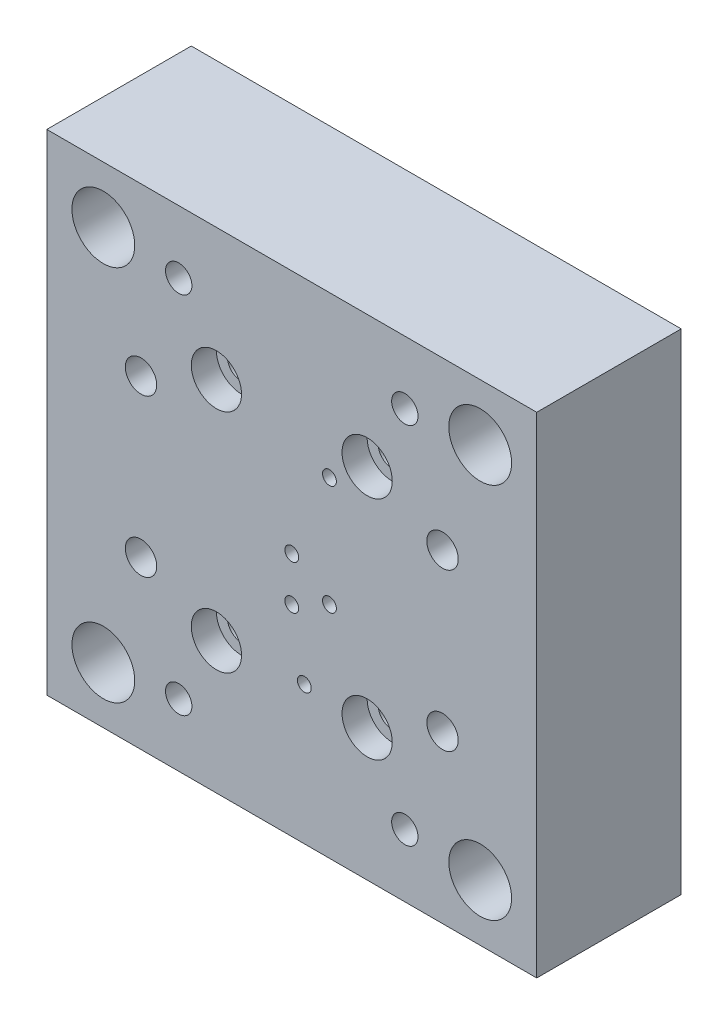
ISO-10303-21;
HEADER;
FILE_DESCRIPTION(('STEP AP214'),'2;1');
FILE_NAME('part.step','',(''),(''),'','','');
FILE_SCHEMA(('AUTOMOTIVE_DESIGN { 1 0 10303 214 1 1 1 1 }'));
ENDSEC;
DATA;
#1=APPLICATION_CONTEXT('core data for automotive mechanical design processes');
#2=APPLICATION_PROTOCOL_DEFINITION('international standard','automotive_design',2000,#1);
#3=PRODUCT_CONTEXT('',#1,'mechanical');
#4=PRODUCT('Part','Part','',(#3));
#5=PRODUCT_RELATED_PRODUCT_CATEGORY('part','',(#4));
#6=PRODUCT_DEFINITION_FORMATION('','',#4);
#7=PRODUCT_DEFINITION_CONTEXT('part definition',#1,'design');
#8=PRODUCT_DEFINITION('design','',#6,#7);
#9=PRODUCT_DEFINITION_SHAPE('','',#8);
#10=(LENGTH_UNIT() NAMED_UNIT(*) SI_UNIT(.MILLI.,.METRE.));
#11=(NAMED_UNIT(*) PLANE_ANGLE_UNIT() SI_UNIT($,.RADIAN.));
#12=(NAMED_UNIT(*) SI_UNIT($,.STERADIAN.) SOLID_ANGLE_UNIT());
#13=UNCERTAINTY_MEASURE_WITH_UNIT(LENGTH_MEASURE(1.E-05),#10,'distance_accuracy_value','');
#14=(GEOMETRIC_REPRESENTATION_CONTEXT(3) GLOBAL_UNCERTAINTY_ASSIGNED_CONTEXT((#13)) GLOBAL_UNIT_ASSIGNED_CONTEXT((#10,
#11,#12)) REPRESENTATION_CONTEXT('',''));
#15=CARTESIAN_POINT('',(0.,0.,0.));
#16=DIRECTION('',(0.,0.,1.));
#17=DIRECTION('',(1.,0.,0.));
#18=AXIS2_PLACEMENT_3D('',#15,#16,#17);
#19=CARTESIAN_POINT('',(-39.,-39.,0.));
#20=DIRECTION('',(0.,0.,1.));
#21=DIRECTION('',(1.,0.,0.));
#22=AXIS2_PLACEMENT_3D('',#19,#20,#21);
#23=PLANE('',#22);
#24=DIRECTION('',(0.,-1.,0.));
#25=VECTOR('',#24,1.);
#26=CARTESIAN_POINT('',(-39.,39.,0.));
#27=LINE('',#26,#25);
#28=CARTESIAN_POINT('',(-39.,39.,0.));
#29=VERTEX_POINT('',#28);
#30=CARTESIAN_POINT('',(-39.,-39.,0.));
#31=VERTEX_POINT('',#30);
#32=EDGE_CURVE('E282',#29,#31,#27,.T.);
#33=ORIENTED_EDGE('',*,*,#32,.F.);
#34=DIRECTION('',(-1.,0.,0.));
#35=VECTOR('',#34,1.);
#36=CARTESIAN_POINT('',(-39.,39.,0.));
#37=LINE('',#36,#35);
#38=CARTESIAN_POINT('',(39.,39.,0.));
#39=VERTEX_POINT('',#38);
#40=EDGE_CURVE('E289',#39,#29,#37,.T.);
#41=ORIENTED_EDGE('',*,*,#40,.F.);
#42=DIRECTION('',(0.,1.,0.));
#43=VECTOR('',#42,1.);
#44=CARTESIAN_POINT('',(39.,39.,0.));
#45=LINE('',#44,#43);
#46=CARTESIAN_POINT('',(39.,-39.,0.));
#47=VERTEX_POINT('',#46);
#48=EDGE_CURVE('E287',#47,#39,#45,.T.);
#49=ORIENTED_EDGE('',*,*,#48,.F.);
#50=DIRECTION('',(1.,0.,0.));
#51=VECTOR('',#50,1.);
#52=CARTESIAN_POINT('',(-39.,-39.,0.));
#53=LINE('',#52,#51);
#54=EDGE_CURVE('E285',#31,#47,#53,.T.);
#55=ORIENTED_EDGE('',*,*,#54,.F.);
#56=EDGE_LOOP('',(#33,#41,#49,#55));
#57=FACE_BOUND('',#56,.T.);
#58=CARTESIAN_POINT('',(-30.,30.,0.));
#59=DIRECTION('',(0.,0.,1.));
#60=DIRECTION('',(1.,0.,0.));
#61=AXIS2_PLACEMENT_3D('',#58,#59,#60);
#62=CIRCLE('',#61,5.);
#63=CARTESIAN_POINT('',(-25.,30.,0.));
#64=VERTEX_POINT('',#63);
#65=EDGE_CURVE('E279',#64,#64,#62,.T.);
#66=ORIENTED_EDGE('',*,*,#65,.T.);
#67=EDGE_LOOP('',(#66));
#68=FACE_BOUND('',#67,.T.);
#69=CARTESIAN_POINT('',(30.,30.,0.));
#70=DIRECTION('',(0.,0.,1.));
#71=DIRECTION('',(1.,0.,0.));
#72=AXIS2_PLACEMENT_3D('',#69,#70,#71);
#73=CIRCLE('',#72,5.);
#74=CARTESIAN_POINT('',(35.,30.,0.));
#75=VERTEX_POINT('',#74);
#76=EDGE_CURVE('E273',#75,#75,#73,.T.);
#77=ORIENTED_EDGE('',*,*,#76,.T.);
#78=EDGE_LOOP('',(#77));
#79=FACE_BOUND('',#78,.T.);
#80=CARTESIAN_POINT('',(30.,-30.,0.));
#81=DIRECTION('',(0.,0.,1.));
#82=DIRECTION('',(1.,0.,0.));
#83=AXIS2_PLACEMENT_3D('',#80,#81,#82);
#84=CIRCLE('',#83,5.);
#85=CARTESIAN_POINT('',(35.,-30.,0.));
#86=VERTEX_POINT('',#85);
#87=EDGE_CURVE('E267',#86,#86,#84,.T.);
#88=ORIENTED_EDGE('',*,*,#87,.T.);
#89=EDGE_LOOP('',(#88));
#90=FACE_BOUND('',#89,.T.);
#91=CARTESIAN_POINT('',(-30.,-30.,0.));
#92=DIRECTION('',(0.,0.,1.));
#93=DIRECTION('',(1.,0.,0.));
#94=AXIS2_PLACEMENT_3D('',#91,#92,#93);
#95=CIRCLE('',#94,5.);
#96=CARTESIAN_POINT('',(-25.,-30.,0.));
#97=VERTEX_POINT('',#96);
#98=EDGE_CURVE('E261',#97,#97,#95,.T.);
#99=ORIENTED_EDGE('',*,*,#98,.T.);
#100=EDGE_LOOP('',(#99));
#101=FACE_BOUND('',#100,.T.);
#102=CARTESIAN_POINT('',(24.,12.5,0.));
#103=DIRECTION('',(0.,0.,1.));
#104=DIRECTION('',(1.,0.,0.));
#105=AXIS2_PLACEMENT_3D('',#102,#103,#104);
#106=CIRCLE('',#105,2.49999999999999);
#107=CARTESIAN_POINT('',(26.5,12.5,0.));
#108=VERTEX_POINT('',#107);
#109=EDGE_CURVE('E231',#108,#108,#106,.T.);
#110=ORIENTED_EDGE('',*,*,#109,.T.);
#111=EDGE_LOOP('',(#110));
#112=FACE_BOUND('',#111,.T.);
#113=CARTESIAN_POINT('',(24.,-12.5,0.));
#114=DIRECTION('',(0.,0.,1.));
#115=DIRECTION('',(1.,0.,0.));
#116=AXIS2_PLACEMENT_3D('',#113,#114,#115);
#117=CIRCLE('',#116,2.49999999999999);
#118=CARTESIAN_POINT('',(26.5,-12.5,0.));
#119=VERTEX_POINT('',#118);
#120=EDGE_CURVE('E225',#119,#119,#117,.T.);
#121=ORIENTED_EDGE('',*,*,#120,.T.);
#122=EDGE_LOOP('',(#121));
#123=FACE_BOUND('',#122,.T.);
#124=CARTESIAN_POINT('',(-24.,-12.5,0.));
#125=DIRECTION('',(0.,0.,1.));
#126=DIRECTION('',(1.,0.,0.));
#127=AXIS2_PLACEMENT_3D('',#124,#125,#126);
#128=CIRCLE('',#127,2.5);
#129=CARTESIAN_POINT('',(-21.5,-12.5,0.));
#130=VERTEX_POINT('',#129);
#131=EDGE_CURVE('E219',#130,#130,#128,.T.);
#132=ORIENTED_EDGE('',*,*,#131,.T.);
#133=EDGE_LOOP('',(#132));
#134=FACE_BOUND('',#133,.T.);
#135=CARTESIAN_POINT('',(-24.,12.5,0.));
#136=DIRECTION('',(0.,0.,1.));
#137=DIRECTION('',(1.,0.,0.));
#138=AXIS2_PLACEMENT_3D('',#135,#136,#137);
#139=CIRCLE('',#138,2.5);
#140=CARTESIAN_POINT('',(-21.5,12.5,0.));
#141=VERTEX_POINT('',#140);
#142=EDGE_CURVE('E213',#141,#141,#139,.T.);
#143=ORIENTED_EDGE('',*,*,#142,.T.);
#144=EDGE_LOOP('',(#143));
#145=FACE_BOUND('',#144,.T.);
#146=CARTESIAN_POINT('',(12.,18.,0.));
#147=DIRECTION('',(0.,0.,1.));
#148=DIRECTION('',(-1.,0.,0.));
#149=AXIS2_PLACEMENT_3D('',#146,#147,#148);
#150=CIRCLE('',#149,6.);
#151=CARTESIAN_POINT('',(18.,18.,0.));
#152=VERTEX_POINT('',#151);
#153=CARTESIAN_POINT('',(11.9999999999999,24.,0.));
#154=VERTEX_POINT('',#153);
#155=EDGE_CURVE('E53',#152,#154,#150,.T.);
#156=ORIENTED_EDGE('',*,*,#155,.T.);
#157=DIRECTION('',(-1.,0.,0.));
#158=VECTOR('',#157,1.);
#159=CARTESIAN_POINT('',(-11.9999999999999,24.,0.));
#160=LINE('',#159,#158);
#161=CARTESIAN_POINT('',(-11.9999999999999,24.,0.));
#162=VERTEX_POINT('',#161);
#163=EDGE_CURVE('E142',#154,#162,#160,.T.);
#164=ORIENTED_EDGE('',*,*,#163,.T.);
#165=CARTESIAN_POINT('',(-12.,18.,0.));
#166=DIRECTION('',(0.,0.,1.));
#167=DIRECTION('',(1.,0.,0.));
#168=AXIS2_PLACEMENT_3D('',#165,#166,#167);
#169=CIRCLE('',#168,6.);
#170=CARTESIAN_POINT('',(-18.,18.,0.));
#171=VERTEX_POINT('',#170);
#172=EDGE_CURVE('E150',#162,#171,#169,.T.);
#173=ORIENTED_EDGE('',*,*,#172,.T.);
#174=DIRECTION('',(0.,-1.,0.));
#175=VECTOR('',#174,1.);
#176=CARTESIAN_POINT('',(-18.,18.,0.));
#177=LINE('',#176,#175);
#178=CARTESIAN_POINT('',(-18.,-18.,0.));
#179=VERTEX_POINT('',#178);
#180=EDGE_CURVE('E171',#171,#179,#177,.T.);
#181=ORIENTED_EDGE('',*,*,#180,.T.);
#182=CARTESIAN_POINT('',(-12.,-18.,0.));
#183=DIRECTION('',(0.,0.,1.));
#184=DIRECTION('',(1.,0.,0.));
#185=AXIS2_PLACEMENT_3D('',#182,#183,#184);
#186=CIRCLE('',#185,6.);
#187=CARTESIAN_POINT('',(-12.,-24.,0.));
#188=VERTEX_POINT('',#187);
#189=EDGE_CURVE('E174',#179,#188,#186,.T.);
#190=ORIENTED_EDGE('',*,*,#189,.T.);
#191=DIRECTION('',(1.,0.,0.));
#192=VECTOR('',#191,1.);
#193=CARTESIAN_POINT('',(-11.9999999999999,-24.,0.));
#194=LINE('',#193,#192);
#195=CARTESIAN_POINT('',(12.,-24.,0.));
#196=VERTEX_POINT('',#195);
#197=EDGE_CURVE('E177',#188,#196,#194,.T.);
#198=ORIENTED_EDGE('',*,*,#197,.T.);
#199=CARTESIAN_POINT('',(12.,-18.,0.));
#200=DIRECTION('',(0.,0.,1.));
#201=DIRECTION('',(1.,0.,0.));
#202=AXIS2_PLACEMENT_3D('',#199,#200,#201);
#203=CIRCLE('',#202,6.);
#204=CARTESIAN_POINT('',(18.,-18.,0.));
#205=VERTEX_POINT('',#204);
#206=EDGE_CURVE('E180',#196,#205,#203,.T.);
#207=ORIENTED_EDGE('',*,*,#206,.T.);
#208=DIRECTION('',(0.,1.,0.));
#209=VECTOR('',#208,1.);
#210=CARTESIAN_POINT('',(18.,18.,0.));
#211=LINE('',#210,#209);
#212=EDGE_CURVE('E161',#205,#152,#211,.T.);
#213=ORIENTED_EDGE('',*,*,#212,.T.);
#214=EDGE_LOOP('',(#156,#164,#173,#181,#190,#198,#207,#213));
#215=FACE_BOUND('',#214,.T.);
#216=ADVANCED_FACE('F36',(#57,#68,#79,#90,#101,#112,#123,#134,#145,#215),#23,.F.);
#217=CARTESIAN_POINT('',(-39.,39.,23.));
#218=DIRECTION('',(1.,0.,0.));
#219=DIRECTION('',(0.,1.,0.));
#220=AXIS2_PLACEMENT_3D('',#217,#218,#219);
#221=PLANE('',#220);
#222=ORIENTED_EDGE('',*,*,#32,.T.);
#223=DIRECTION('',(0.,0.,-1.));
#224=VECTOR('',#223,1.);
#225=CARTESIAN_POINT('',(-39.,-39.,23.));
#226=LINE('',#225,#224);
#227=CARTESIAN_POINT('',(-39.,-39.,23.));
#228=VERTEX_POINT('',#227);
#229=EDGE_CURVE('E11',#228,#31,#226,.T.);
#230=ORIENTED_EDGE('',*,*,#229,.F.);
#231=DIRECTION('',(0.,-1.,0.));
#232=VECTOR('',#231,1.);
#233=CARTESIAN_POINT('',(-39.,39.,23.));
#234=LINE('',#233,#232);
#235=CARTESIAN_POINT('',(-39.,39.,23.));
#236=VERTEX_POINT('',#235);
#237=EDGE_CURVE('E291',#236,#228,#234,.T.);
#238=ORIENTED_EDGE('',*,*,#237,.F.);
#239=DIRECTION('',(0.,0.,-1.));
#240=VECTOR('',#239,1.);
#241=CARTESIAN_POINT('',(-39.,39.,23.));
#242=LINE('',#241,#240);
#243=EDGE_CURVE('E298',#236,#29,#242,.T.);
#244=ORIENTED_EDGE('',*,*,#243,.T.);
#245=EDGE_LOOP('',(#222,#230,#238,#244));
#246=FACE_BOUND('',#245,.T.);
#247=ADVANCED_FACE('F38',(#246),#221,.F.);
#248=CARTESIAN_POINT('',(-39.,-39.,23.));
#249=DIRECTION('',(0.,1.,0.));
#250=DIRECTION('',(-1.,0.,0.));
#251=AXIS2_PLACEMENT_3D('',#248,#249,#250);
#252=PLANE('',#251);
#253=ORIENTED_EDGE('',*,*,#54,.T.);
#254=DIRECTION('',(0.,0.,-1.));
#255=VECTOR('',#254,1.);
#256=CARTESIAN_POINT('',(39.,-39.,23.));
#257=LINE('',#256,#255);
#258=CARTESIAN_POINT('',(39.,-39.,23.));
#259=VERTEX_POINT('',#258);
#260=EDGE_CURVE('E45',#259,#47,#257,.T.);
#261=ORIENTED_EDGE('',*,*,#260,.F.);
#262=DIRECTION('',(1.,0.,0.));
#263=VECTOR('',#262,1.);
#264=CARTESIAN_POINT('',(-39.,-39.,23.));
#265=LINE('',#264,#263);
#266=EDGE_CURVE('E293',#228,#259,#265,.T.);
#267=ORIENTED_EDGE('',*,*,#266,.F.);
#268=ORIENTED_EDGE('',*,*,#229,.T.);
#269=EDGE_LOOP('',(#253,#261,#267,#268));
#270=FACE_BOUND('',#269,.T.);
#271=ADVANCED_FACE('F379',(#270),#252,.F.);
#272=CARTESIAN_POINT('',(39.,39.,23.));
#273=DIRECTION('',(-1.,0.,0.));
#274=DIRECTION('',(0.,-1.,0.));
#275=AXIS2_PLACEMENT_3D('',#272,#273,#274);
#276=PLANE('',#275);
#277=ORIENTED_EDGE('',*,*,#48,.T.);
#278=DIRECTION('',(0.,0.,-1.));
#279=VECTOR('',#278,1.);
#280=CARTESIAN_POINT('',(39.,39.,23.));
#281=LINE('',#280,#279);
#282=CARTESIAN_POINT('',(39.,39.,23.));
#283=VERTEX_POINT('',#282);
#284=EDGE_CURVE('E301',#283,#39,#281,.T.);
#285=ORIENTED_EDGE('',*,*,#284,.F.);
#286=DIRECTION('',(0.,1.,0.));
#287=VECTOR('',#286,1.);
#288=CARTESIAN_POINT('',(39.,39.,23.));
#289=LINE('',#288,#287);
#290=EDGE_CURVE('E295',#259,#283,#289,.T.);
#291=ORIENTED_EDGE('',*,*,#290,.F.);
#292=ORIENTED_EDGE('',*,*,#260,.T.);
#293=EDGE_LOOP('',(#277,#285,#291,#292));
#294=FACE_BOUND('',#293,.T.);
#295=ADVANCED_FACE('F384',(#294),#276,.F.);
#296=CARTESIAN_POINT('',(-39.,39.,23.));
#297=DIRECTION('',(0.,-1.,0.));
#298=DIRECTION('',(1.,0.,0.));
#299=AXIS2_PLACEMENT_3D('',#296,#297,#298);
#300=PLANE('',#299);
#301=ORIENTED_EDGE('',*,*,#40,.T.);
#302=ORIENTED_EDGE('',*,*,#243,.F.);
#303=DIRECTION('',(-1.,0.,0.));
#304=VECTOR('',#303,1.);
#305=CARTESIAN_POINT('',(-39.,39.,23.));
#306=LINE('',#305,#304);
#307=EDGE_CURVE('E61',#283,#236,#306,.T.);
#308=ORIENTED_EDGE('',*,*,#307,.F.);
#309=ORIENTED_EDGE('',*,*,#284,.T.);
#310=EDGE_LOOP('',(#301,#302,#308,#309));
#311=FACE_BOUND('',#310,.T.);
#312=ADVANCED_FACE('F347',(#311),#300,.F.);
#313=CARTESIAN_POINT('',(-39.,-39.,23.));
#314=DIRECTION('',(0.,0.,1.));
#315=DIRECTION('',(1.,0.,0.));
#316=AXIS2_PLACEMENT_3D('',#313,#314,#315);
#317=PLANE('',#316);
#318=CARTESIAN_POINT('',(6.,13.5,23.));
#319=DIRECTION('',(0.,0.,-1.));
#320=DIRECTION('',(-1.,0.,0.));
#321=AXIS2_PLACEMENT_3D('',#318,#319,#320);
#322=CIRCLE('',#321,1.1);
#323=CARTESIAN_POINT('',(4.9,13.5,23.));
#324=VERTEX_POINT('',#323);
#325=EDGE_CURVE('E758',#324,#324,#322,.T.);
#326=ORIENTED_EDGE('',*,*,#325,.T.);
#327=EDGE_LOOP('',(#326));
#328=FACE_BOUND('',#327,.T.);
#329=CARTESIAN_POINT('',(6.,-4.,23.));
#330=DIRECTION('',(0.,0.,-1.));
#331=DIRECTION('',(-1.,0.,0.));
#332=AXIS2_PLACEMENT_3D('',#329,#330,#331);
#333=CIRCLE('',#332,1.1);
#334=CARTESIAN_POINT('',(4.9,-4.,23.));
#335=VERTEX_POINT('',#334);
#336=EDGE_CURVE('E768',#335,#335,#333,.T.);
#337=ORIENTED_EDGE('',*,*,#336,.T.);
#338=EDGE_LOOP('',(#337));
#339=FACE_BOUND('',#338,.T.);
#340=CARTESIAN_POINT('',(2.,-17.,23.));
#341=DIRECTION('',(0.,0.,-1.));
#342=DIRECTION('',(-1.,0.,0.));
#343=AXIS2_PLACEMENT_3D('',#340,#341,#342);
#344=CIRCLE('',#343,1.1);
#345=CARTESIAN_POINT('',(0.899999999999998,-17.,23.));
#346=VERTEX_POINT('',#345);
#347=EDGE_CURVE('E774',#346,#346,#344,.T.);
#348=ORIENTED_EDGE('',*,*,#347,.T.);
#349=EDGE_LOOP('',(#348));
#350=FACE_BOUND('',#349,.T.);
#351=CARTESIAN_POINT('',(0.,-7.,23.));
#352=DIRECTION('',(0.,0.,-1.));
#353=DIRECTION('',(-1.,0.,0.));
#354=AXIS2_PLACEMENT_3D('',#351,#352,#353);
#355=CIRCLE('',#354,1.1);
#356=CARTESIAN_POINT('',(-1.1,-7.,23.));
#357=VERTEX_POINT('',#356);
#358=EDGE_CURVE('E780',#357,#357,#355,.T.);
#359=ORIENTED_EDGE('',*,*,#358,.T.);
#360=EDGE_LOOP('',(#359));
#361=FACE_BOUND('',#360,.T.);
#362=CARTESIAN_POINT('',(0.,0.,23.));
#363=DIRECTION('',(0.,0.,-1.));
#364=DIRECTION('',(-1.,0.,0.));
#365=AXIS2_PLACEMENT_3D('',#362,#363,#364);
#366=CIRCLE('',#365,1.1);
#367=CARTESIAN_POINT('',(-1.1,0.,23.));
#368=VERTEX_POINT('',#367);
#369=EDGE_CURVE('E786',#368,#368,#366,.T.);
#370=ORIENTED_EDGE('',*,*,#369,.T.);
#371=EDGE_LOOP('',(#370));
#372=FACE_BOUND('',#371,.T.);
#373=CARTESIAN_POINT('',(12.,18.,23.));
#374=DIRECTION('',(0.,0.,1.));
#375=DIRECTION('',(1.,0.,0.));
#376=AXIS2_PLACEMENT_3D('',#373,#374,#375);
#377=CIRCLE('',#376,4.);
#378=CARTESIAN_POINT('',(16.,18.,23.));
#379=VERTEX_POINT('',#378);
#380=EDGE_CURVE('E795',#379,#379,#377,.T.);
#381=ORIENTED_EDGE('',*,*,#380,.F.);
#382=EDGE_LOOP('',(#381));
#383=FACE_BOUND('',#382,.T.);
#384=CARTESIAN_POINT('',(-12.,18.,23.));
#385=DIRECTION('',(0.,0.,1.));
#386=DIRECTION('',(1.,0.,0.));
#387=AXIS2_PLACEMENT_3D('',#384,#385,#386);
#388=CIRCLE('',#387,4.);
#389=CARTESIAN_POINT('',(-8.00000000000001,18.,23.));
#390=VERTEX_POINT('',#389);
#391=EDGE_CURVE('E313',#390,#390,#388,.T.);
#392=ORIENTED_EDGE('',*,*,#391,.F.);
#393=EDGE_LOOP('',(#392));
#394=FACE_BOUND('',#393,.T.);
#395=CARTESIAN_POINT('',(-12.,-18.,23.));
#396=DIRECTION('',(0.,0.,1.));
#397=DIRECTION('',(1.,0.,0.));
#398=AXIS2_PLACEMENT_3D('',#395,#396,#397);
#399=CIRCLE('',#398,4.);
#400=CARTESIAN_POINT('',(-7.99999999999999,-18.,23.));
#401=VERTEX_POINT('',#400);
#402=EDGE_CURVE('E309',#401,#401,#399,.T.);
#403=ORIENTED_EDGE('',*,*,#402,.F.);
#404=EDGE_LOOP('',(#403));
#405=FACE_BOUND('',#404,.T.);
#406=CARTESIAN_POINT('',(12.,-18.,23.));
#407=DIRECTION('',(0.,0.,1.));
#408=DIRECTION('',(1.,0.,0.));
#409=AXIS2_PLACEMENT_3D('',#406,#407,#408);
#410=CIRCLE('',#409,4.);
#411=CARTESIAN_POINT('',(16.,-18.,23.));
#412=VERTEX_POINT('',#411);
#413=EDGE_CURVE('E165',#412,#412,#410,.T.);
#414=ORIENTED_EDGE('',*,*,#413,.F.);
#415=EDGE_LOOP('',(#414));
#416=FACE_BOUND('',#415,.T.);
#417=CARTESIAN_POINT('',(-24.,12.5,23.));
#418=DIRECTION('',(0.,0.,1.));
#419=DIRECTION('',(1.,0.,0.));
#420=AXIS2_PLACEMENT_3D('',#417,#418,#419);
#421=CIRCLE('',#420,2.5);
#422=CARTESIAN_POINT('',(-21.5,12.5,23.));
#423=VERTEX_POINT('',#422);
#424=EDGE_CURVE('E156',#423,#423,#421,.T.);
#425=ORIENTED_EDGE('',*,*,#424,.F.);
#426=EDGE_LOOP('',(#425));
#427=FACE_BOUND('',#426,.T.);
#428=CARTESIAN_POINT('',(-24.,-12.5,23.));
#429=DIRECTION('',(0.,0.,1.));
#430=DIRECTION('',(1.,0.,0.));
#431=AXIS2_PLACEMENT_3D('',#428,#429,#430);
#432=CIRCLE('',#431,2.5);
#433=CARTESIAN_POINT('',(-21.5,-12.5,23.));
#434=VERTEX_POINT('',#433);
#435=EDGE_CURVE('E216',#434,#434,#432,.T.);
#436=ORIENTED_EDGE('',*,*,#435,.F.);
#437=EDGE_LOOP('',(#436));
#438=FACE_BOUND('',#437,.T.);
#439=CARTESIAN_POINT('',(24.,-12.5,23.));
#440=DIRECTION('',(0.,0.,1.));
#441=DIRECTION('',(1.,0.,0.));
#442=AXIS2_PLACEMENT_3D('',#439,#440,#441);
#443=CIRCLE('',#442,2.49999999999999);
#444=CARTESIAN_POINT('',(26.5,-12.5,23.));
#445=VERTEX_POINT('',#444);
#446=EDGE_CURVE('E222',#445,#445,#443,.T.);
#447=ORIENTED_EDGE('',*,*,#446,.F.);
#448=EDGE_LOOP('',(#447));
#449=FACE_BOUND('',#448,.T.);
#450=CARTESIAN_POINT('',(24.,12.5,23.));
#451=DIRECTION('',(0.,0.,1.));
#452=DIRECTION('',(1.,0.,0.));
#453=AXIS2_PLACEMENT_3D('',#450,#451,#452);
#454=CIRCLE('',#453,2.49999999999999);
#455=CARTESIAN_POINT('',(26.5,12.5,23.));
#456=VERTEX_POINT('',#455);
#457=EDGE_CURVE('E228',#456,#456,#454,.T.);
#458=ORIENTED_EDGE('',*,*,#457,.F.);
#459=EDGE_LOOP('',(#458));
#460=FACE_BOUND('',#459,.T.);
#461=CARTESIAN_POINT('',(18.,29.,23.));
#462=DIRECTION('',(0.,0.,1.));
#463=DIRECTION('',(1.,0.,0.));
#464=AXIS2_PLACEMENT_3D('',#461,#462,#463);
#465=CIRCLE('',#464,2.1);
#466=CARTESIAN_POINT('',(20.1,29.,23.));
#467=VERTEX_POINT('',#466);
#468=EDGE_CURVE('E237',#467,#467,#465,.T.);
#469=ORIENTED_EDGE('',*,*,#468,.F.);
#470=EDGE_LOOP('',(#469));
#471=FACE_BOUND('',#470,.T.);
#472=CARTESIAN_POINT('',(-18.,29.,23.));
#473=DIRECTION('',(0.,0.,1.));
#474=DIRECTION('',(1.,0.,0.));
#475=AXIS2_PLACEMENT_3D('',#472,#473,#474);
#476=CIRCLE('',#475,2.1);
#477=CARTESIAN_POINT('',(-15.9,29.,23.));
#478=VERTEX_POINT('',#477);
#479=EDGE_CURVE('E243',#478,#478,#476,.T.);
#480=ORIENTED_EDGE('',*,*,#479,.F.);
#481=EDGE_LOOP('',(#480));
#482=FACE_BOUND('',#481,.T.);
#483=CARTESIAN_POINT('',(-18.,-29.,23.));
#484=DIRECTION('',(0.,0.,1.));
#485=DIRECTION('',(1.,0.,0.));
#486=AXIS2_PLACEMENT_3D('',#483,#484,#485);
#487=CIRCLE('',#486,2.1);
#488=CARTESIAN_POINT('',(-15.9,-29.,23.));
#489=VERTEX_POINT('',#488);
#490=EDGE_CURVE('E249',#489,#489,#487,.T.);
#491=ORIENTED_EDGE('',*,*,#490,.F.);
#492=EDGE_LOOP('',(#491));
#493=FACE_BOUND('',#492,.T.);
#494=CARTESIAN_POINT('',(18.,-29.,23.));
#495=DIRECTION('',(0.,0.,1.));
#496=DIRECTION('',(1.,0.,0.));
#497=AXIS2_PLACEMENT_3D('',#494,#495,#496);
#498=CIRCLE('',#497,2.1);
#499=CARTESIAN_POINT('',(20.1,-29.,23.));
#500=VERTEX_POINT('',#499);
#501=EDGE_CURVE('E255',#500,#500,#498,.T.);
#502=ORIENTED_EDGE('',*,*,#501,.F.);
#503=EDGE_LOOP('',(#502));
#504=FACE_BOUND('',#503,.T.);
#505=CARTESIAN_POINT('',(-30.,-30.,23.));
#506=DIRECTION('',(0.,0.,1.));
#507=DIRECTION('',(1.,0.,0.));
#508=AXIS2_PLACEMENT_3D('',#505,#506,#507);
#509=CIRCLE('',#508,5.);
#510=CARTESIAN_POINT('',(-25.,-30.,23.));
#511=VERTEX_POINT('',#510);
#512=EDGE_CURVE('E258',#511,#511,#509,.T.);
#513=ORIENTED_EDGE('',*,*,#512,.F.);
#514=EDGE_LOOP('',(#513));
#515=FACE_BOUND('',#514,.T.);
#516=CARTESIAN_POINT('',(30.,-30.,23.));
#517=DIRECTION('',(0.,0.,1.));
#518=DIRECTION('',(1.,0.,0.));
#519=AXIS2_PLACEMENT_3D('',#516,#517,#518);
#520=CIRCLE('',#519,5.);
#521=CARTESIAN_POINT('',(35.,-30.,23.));
#522=VERTEX_POINT('',#521);
#523=EDGE_CURVE('E264',#522,#522,#520,.T.);
#524=ORIENTED_EDGE('',*,*,#523,.F.);
#525=EDGE_LOOP('',(#524));
#526=FACE_BOUND('',#525,.T.);
#527=CARTESIAN_POINT('',(30.,30.,23.));
#528=DIRECTION('',(0.,0.,1.));
#529=DIRECTION('',(1.,0.,0.));
#530=AXIS2_PLACEMENT_3D('',#527,#528,#529);
#531=CIRCLE('',#530,5.);
#532=CARTESIAN_POINT('',(35.,30.,23.));
#533=VERTEX_POINT('',#532);
#534=EDGE_CURVE('E270',#533,#533,#531,.T.);
#535=ORIENTED_EDGE('',*,*,#534,.F.);
#536=EDGE_LOOP('',(#535));
#537=FACE_BOUND('',#536,.T.);
#538=CARTESIAN_POINT('',(-30.,30.,23.));
#539=DIRECTION('',(0.,0.,1.));
#540=DIRECTION('',(1.,0.,0.));
#541=AXIS2_PLACEMENT_3D('',#538,#539,#540);
#542=CIRCLE('',#541,5.);
#543=CARTESIAN_POINT('',(-25.,30.,23.));
#544=VERTEX_POINT('',#543);
#545=EDGE_CURVE('E276',#544,#544,#542,.T.);
#546=ORIENTED_EDGE('',*,*,#545,.F.);
#547=EDGE_LOOP('',(#546));
#548=FACE_BOUND('',#547,.T.);
#549=ORIENTED_EDGE('',*,*,#237,.T.);
#550=ORIENTED_EDGE('',*,*,#266,.T.);
#551=ORIENTED_EDGE('',*,*,#290,.T.);
#552=ORIENTED_EDGE('',*,*,#307,.T.);
#553=EDGE_LOOP('',(#549,#550,#551,#552));
#554=FACE_BOUND('',#553,.T.);
#555=ADVANCED_FACE('F343',(#328,#339,#350,#361,#372,#383,#394,#405,#416,#427,#438,#449,#460,
#471,#482,#493,#504,#515,#526,#537,#548,#554),#317,.T.);
#556=CARTESIAN_POINT('',(-30.,30.,0.));
#557=DIRECTION('',(0.,0.,1.));
#558=DIRECTION('',(1.,0.,0.));
#559=AXIS2_PLACEMENT_3D('',#556,#557,#558);
#560=CYLINDRICAL_SURFACE('',#559,5.);
#561=ORIENTED_EDGE('',*,*,#65,.F.);
#562=EDGE_LOOP('',(#561));
#563=FACE_BOUND('',#562,.T.);
#564=ORIENTED_EDGE('',*,*,#545,.T.);
#565=EDGE_LOOP('',(#564));
#566=FACE_BOUND('',#565,.T.);
#567=ADVANCED_FACE('F346',(#563,#566),#560,.F.);
#568=CARTESIAN_POINT('',(30.,30.,0.));
#569=DIRECTION('',(0.,0.,1.));
#570=DIRECTION('',(1.,0.,0.));
#571=AXIS2_PLACEMENT_3D('',#568,#569,#570);
#572=CYLINDRICAL_SURFACE('',#571,5.);
#573=ORIENTED_EDGE('',*,*,#76,.F.);
#574=EDGE_LOOP('',(#573));
#575=FACE_BOUND('',#574,.T.);
#576=ORIENTED_EDGE('',*,*,#534,.T.);
#577=EDGE_LOOP('',(#576));
#578=FACE_BOUND('',#577,.T.);
#579=ADVANCED_FACE('F468',(#575,#578),#572,.F.);
#580=CARTESIAN_POINT('',(30.,-30.,0.));
#581=DIRECTION('',(0.,0.,1.));
#582=DIRECTION('',(1.,0.,0.));
#583=AXIS2_PLACEMENT_3D('',#580,#581,#582);
#584=CYLINDRICAL_SURFACE('',#583,5.);
#585=ORIENTED_EDGE('',*,*,#87,.F.);
#586=EDGE_LOOP('',(#585));
#587=FACE_BOUND('',#586,.T.);
#588=ORIENTED_EDGE('',*,*,#523,.T.);
#589=EDGE_LOOP('',(#588));
#590=FACE_BOUND('',#589,.T.);
#591=ADVANCED_FACE('F464',(#587,#590),#584,.F.);
#592=CARTESIAN_POINT('',(-30.,-30.,0.));
#593=DIRECTION('',(0.,0.,1.));
#594=DIRECTION('',(1.,0.,0.));
#595=AXIS2_PLACEMENT_3D('',#592,#593,#594);
#596=CYLINDRICAL_SURFACE('',#595,5.);
#597=ORIENTED_EDGE('',*,*,#98,.F.);
#598=EDGE_LOOP('',(#597));
#599=FACE_BOUND('',#598,.T.);
#600=ORIENTED_EDGE('',*,*,#512,.T.);
#601=EDGE_LOOP('',(#600));
#602=FACE_BOUND('',#601,.T.);
#603=ADVANCED_FACE('F460',(#599,#602),#596,.F.);
#604=CARTESIAN_POINT('',(18.,-29.,23.));
#605=DIRECTION('',(0.,0.,1.));
#606=DIRECTION('',(1.,0.,0.));
#607=AXIS2_PLACEMENT_3D('',#604,#605,#606);
#608=CYLINDRICAL_SURFACE('',#607,2.1);
#609=CARTESIAN_POINT('',(18.,-29.,9.));
#610=DIRECTION('',(0.,0.,1.));
#611=DIRECTION('',(1.,0.,0.));
#612=AXIS2_PLACEMENT_3D('',#609,#610,#611);
#613=CIRCLE('',#612,2.1);
#614=CARTESIAN_POINT('',(20.1,-29.,9.));
#615=VERTEX_POINT('',#614);
#616=EDGE_CURVE('E252',#615,#615,#613,.T.);
#617=ORIENTED_EDGE('',*,*,#616,.F.);
#618=EDGE_LOOP('',(#617));
#619=FACE_BOUND('',#618,.T.);
#620=ORIENTED_EDGE('',*,*,#501,.T.);
#621=EDGE_LOOP('',(#620));
#622=FACE_BOUND('',#621,.T.);
#623=ADVANCED_FACE('F456',(#619,#622),#608,.F.);
#624=CARTESIAN_POINT('',(18.,-29.,9.));
#625=DIRECTION('',(0.,0.,1.));
#626=DIRECTION('',(1.,0.,0.));
#627=AXIS2_PLACEMENT_3D('',#624,#625,#626);
#628=CONICAL_SURFACE('',#627,2.1,1.02974425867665);
#629=CARTESIAN_POINT('',(18.,-29.,7.73819270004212));
#630=VERTEX_POINT('',#629);
#631=VERTEX_LOOP('',#630);
#632=FACE_BOUND('',#631,.T.);
#633=ORIENTED_EDGE('',*,*,#616,.T.);
#634=EDGE_LOOP('',(#633));
#635=FACE_BOUND('',#634,.T.);
#636=ADVANCED_FACE('F452',(#632,#635),#628,.F.);
#637=CARTESIAN_POINT('',(-18.,-29.,23.));
#638=DIRECTION('',(0.,0.,1.));
#639=DIRECTION('',(1.,0.,0.));
#640=AXIS2_PLACEMENT_3D('',#637,#638,#639);
#641=CYLINDRICAL_SURFACE('',#640,2.1);
#642=CARTESIAN_POINT('',(-18.,-29.,9.));
#643=DIRECTION('',(0.,0.,1.));
#644=DIRECTION('',(1.,0.,0.));
#645=AXIS2_PLACEMENT_3D('',#642,#643,#644);
#646=CIRCLE('',#645,2.1);
#647=CARTESIAN_POINT('',(-15.9,-29.,9.));
#648=VERTEX_POINT('',#647);
#649=EDGE_CURVE('E246',#648,#648,#646,.T.);
#650=ORIENTED_EDGE('',*,*,#649,.F.);
#651=EDGE_LOOP('',(#650));
#652=FACE_BOUND('',#651,.T.);
#653=ORIENTED_EDGE('',*,*,#490,.T.);
#654=EDGE_LOOP('',(#653));
#655=FACE_BOUND('',#654,.T.);
#656=ADVANCED_FACE('F448',(#652,#655),#641,.F.);
#657=CARTESIAN_POINT('',(-18.,-29.,9.));
#658=DIRECTION('',(0.,0.,1.));
#659=DIRECTION('',(1.,0.,0.));
#660=AXIS2_PLACEMENT_3D('',#657,#658,#659);
#661=CONICAL_SURFACE('',#660,2.1,1.02974425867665);
#662=CARTESIAN_POINT('',(-18.,-29.,7.73819270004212));
#663=VERTEX_POINT('',#662);
#664=VERTEX_LOOP('',#663);
#665=FACE_BOUND('',#664,.T.);
#666=ORIENTED_EDGE('',*,*,#649,.T.);
#667=EDGE_LOOP('',(#666));
#668=FACE_BOUND('',#667,.T.);
#669=ADVANCED_FACE('F444',(#665,#668),#661,.F.);
#670=CARTESIAN_POINT('',(-18.,29.,23.));
#671=DIRECTION('',(0.,0.,1.));
#672=DIRECTION('',(1.,0.,0.));
#673=AXIS2_PLACEMENT_3D('',#670,#671,#672);
#674=CYLINDRICAL_SURFACE('',#673,2.1);
#675=CARTESIAN_POINT('',(-18.,29.,9.));
#676=DIRECTION('',(0.,0.,1.));
#677=DIRECTION('',(1.,0.,0.));
#678=AXIS2_PLACEMENT_3D('',#675,#676,#677);
#679=CIRCLE('',#678,2.1);
#680=CARTESIAN_POINT('',(-15.9,29.,9.));
#681=VERTEX_POINT('',#680);
#682=EDGE_CURVE('E240',#681,#681,#679,.T.);
#683=ORIENTED_EDGE('',*,*,#682,.F.);
#684=EDGE_LOOP('',(#683));
#685=FACE_BOUND('',#684,.T.);
#686=ORIENTED_EDGE('',*,*,#479,.T.);
#687=EDGE_LOOP('',(#686));
#688=FACE_BOUND('',#687,.T.);
#689=ADVANCED_FACE('F440',(#685,#688),#674,.F.);
#690=CARTESIAN_POINT('',(-18.,29.,9.));
#691=DIRECTION('',(0.,0.,1.));
#692=DIRECTION('',(1.,0.,0.));
#693=AXIS2_PLACEMENT_3D('',#690,#691,#692);
#694=CONICAL_SURFACE('',#693,2.1,1.02974425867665);
#695=CARTESIAN_POINT('',(-18.,29.,7.73819270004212));
#696=VERTEX_POINT('',#695);
#697=VERTEX_LOOP('',#696);
#698=FACE_BOUND('',#697,.T.);
#699=ORIENTED_EDGE('',*,*,#682,.T.);
#700=EDGE_LOOP('',(#699));
#701=FACE_BOUND('',#700,.T.);
#702=ADVANCED_FACE('F436',(#698,#701),#694,.F.);
#703=CARTESIAN_POINT('',(18.,29.,23.));
#704=DIRECTION('',(0.,0.,1.));
#705=DIRECTION('',(1.,0.,0.));
#706=AXIS2_PLACEMENT_3D('',#703,#704,#705);
#707=CYLINDRICAL_SURFACE('',#706,2.1);
#708=CARTESIAN_POINT('',(18.,29.,9.));
#709=DIRECTION('',(0.,0.,1.));
#710=DIRECTION('',(1.,0.,0.));
#711=AXIS2_PLACEMENT_3D('',#708,#709,#710);
#712=CIRCLE('',#711,2.1);
#713=CARTESIAN_POINT('',(20.1,29.,9.));
#714=VERTEX_POINT('',#713);
#715=EDGE_CURVE('E234',#714,#714,#712,.T.);
#716=ORIENTED_EDGE('',*,*,#715,.F.);
#717=EDGE_LOOP('',(#716));
#718=FACE_BOUND('',#717,.T.);
#719=ORIENTED_EDGE('',*,*,#468,.T.);
#720=EDGE_LOOP('',(#719));
#721=FACE_BOUND('',#720,.T.);
#722=ADVANCED_FACE('F432',(#718,#721),#707,.F.);
#723=CARTESIAN_POINT('',(18.,29.,9.));
#724=DIRECTION('',(0.,0.,1.));
#725=DIRECTION('',(1.,0.,0.));
#726=AXIS2_PLACEMENT_3D('',#723,#724,#725);
#727=CONICAL_SURFACE('',#726,2.1,1.02974425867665);
#728=CARTESIAN_POINT('',(18.,29.,7.73819270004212));
#729=VERTEX_POINT('',#728);
#730=VERTEX_LOOP('',#729);
#731=FACE_BOUND('',#730,.T.);
#732=ORIENTED_EDGE('',*,*,#715,.T.);
#733=EDGE_LOOP('',(#732));
#734=FACE_BOUND('',#733,.T.);
#735=ADVANCED_FACE('F428',(#731,#734),#727,.F.);
#736=CARTESIAN_POINT('',(24.,12.5,0.));
#737=DIRECTION('',(0.,0.,1.));
#738=DIRECTION('',(1.,0.,0.));
#739=AXIS2_PLACEMENT_3D('',#736,#737,#738);
#740=CYLINDRICAL_SURFACE('',#739,2.49999999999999);
#741=ORIENTED_EDGE('',*,*,#109,.F.);
#742=EDGE_LOOP('',(#741));
#743=FACE_BOUND('',#742,.T.);
#744=ORIENTED_EDGE('',*,*,#457,.T.);
#745=EDGE_LOOP('',(#744));
#746=FACE_BOUND('',#745,.T.);
#747=ADVANCED_FACE('F424',(#743,#746),#740,.F.);
#748=CARTESIAN_POINT('',(24.,-12.5,0.));
#749=DIRECTION('',(0.,0.,1.));
#750=DIRECTION('',(1.,0.,0.));
#751=AXIS2_PLACEMENT_3D('',#748,#749,#750);
#752=CYLINDRICAL_SURFACE('',#751,2.49999999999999);
#753=ORIENTED_EDGE('',*,*,#120,.F.);
#754=EDGE_LOOP('',(#753));
#755=FACE_BOUND('',#754,.T.);
#756=ORIENTED_EDGE('',*,*,#446,.T.);
#757=EDGE_LOOP('',(#756));
#758=FACE_BOUND('',#757,.T.);
#759=ADVANCED_FACE('F417',(#755,#758),#752,.F.);
#760=CARTESIAN_POINT('',(-24.,-12.5,0.));
#761=DIRECTION('',(0.,0.,1.));
#762=DIRECTION('',(1.,0.,0.));
#763=AXIS2_PLACEMENT_3D('',#760,#761,#762);
#764=CYLINDRICAL_SURFACE('',#763,2.5);
#765=ORIENTED_EDGE('',*,*,#131,.F.);
#766=EDGE_LOOP('',(#765));
#767=FACE_BOUND('',#766,.T.);
#768=ORIENTED_EDGE('',*,*,#435,.T.);
#769=EDGE_LOOP('',(#768));
#770=FACE_BOUND('',#769,.T.);
#771=ADVANCED_FACE('F410',(#767,#770),#764,.F.);
#772=CARTESIAN_POINT('',(-24.,12.5,0.));
#773=DIRECTION('',(0.,0.,1.));
#774=DIRECTION('',(1.,0.,0.));
#775=AXIS2_PLACEMENT_3D('',#772,#773,#774);
#776=CYLINDRICAL_SURFACE('',#775,2.5);
#777=ORIENTED_EDGE('',*,*,#142,.F.);
#778=EDGE_LOOP('',(#777));
#779=FACE_BOUND('',#778,.T.);
#780=ORIENTED_EDGE('',*,*,#424,.T.);
#781=EDGE_LOOP('',(#780));
#782=FACE_BOUND('',#781,.T.);
#783=ADVANCED_FACE('F407',(#779,#782),#776,.F.);
#784=CARTESIAN_POINT('',(12.,18.,12.));
#785=DIRECTION('',(0.,0.,-1.));
#786=DIRECTION('',(-1.,0.,0.));
#787=AXIS2_PLACEMENT_3D('',#784,#785,#786);
#788=CYLINDRICAL_SURFACE('',#787,6.);
#789=ORIENTED_EDGE('',*,*,#155,.F.);
#790=DIRECTION('',(0.,0.,-1.));
#791=VECTOR('',#790,1.);
#792=CARTESIAN_POINT('',(18.,18.,12.));
#793=LINE('',#792,#791);
#794=CARTESIAN_POINT('',(18.,18.,12.));
#795=VERTEX_POINT('',#794);
#796=EDGE_CURVE('E198',#795,#152,#793,.T.);
#797=ORIENTED_EDGE('',*,*,#796,.F.);
#798=CARTESIAN_POINT('',(12.,18.,12.));
#799=DIRECTION('',(0.,0.,1.));
#800=DIRECTION('',(-1.,0.,0.));
#801=AXIS2_PLACEMENT_3D('',#798,#799,#800);
#802=CIRCLE('',#801,6.);
#803=CARTESIAN_POINT('',(11.9999999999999,24.,12.));
#804=VERTEX_POINT('',#803);
#805=EDGE_CURVE('E155',#795,#804,#802,.T.);
#806=ORIENTED_EDGE('',*,*,#805,.T.);
#807=DIRECTION('',(0.,0.,-1.));
#808=VECTOR('',#807,1.);
#809=CARTESIAN_POINT('',(11.9999999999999,24.,12.));
#810=LINE('',#809,#808);
#811=EDGE_CURVE('E144',#804,#154,#810,.T.);
#812=ORIENTED_EDGE('',*,*,#811,.T.);
#813=EDGE_LOOP('',(#789,#797,#806,#812));
#814=FACE_BOUND('',#813,.T.);
#815=ADVANCED_FACE('F153',(#814),#788,.F.);
#816=CARTESIAN_POINT('',(-11.9999999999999,24.,12.));
#817=DIRECTION('',(0.,-1.,0.));
#818=DIRECTION('',(1.,0.,0.));
#819=AXIS2_PLACEMENT_3D('',#816,#817,#818);
#820=PLANE('',#819);
#821=ORIENTED_EDGE('',*,*,#163,.F.);
#822=ORIENTED_EDGE('',*,*,#811,.F.);
#823=DIRECTION('',(-1.,0.,0.));
#824=VECTOR('',#823,1.);
#825=CARTESIAN_POINT('',(-11.9999999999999,24.,12.));
#826=LINE('',#825,#824);
#827=CARTESIAN_POINT('',(-11.9999999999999,24.,12.));
#828=VERTEX_POINT('',#827);
#829=EDGE_CURVE('E184',#804,#828,#826,.T.);
#830=ORIENTED_EDGE('',*,*,#829,.T.);
#831=DIRECTION('',(0.,0.,-1.));
#832=VECTOR('',#831,1.);
#833=CARTESIAN_POINT('',(-11.9999999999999,24.,12.));
#834=LINE('',#833,#832);
#835=EDGE_CURVE('E146',#828,#162,#834,.T.);
#836=ORIENTED_EDGE('',*,*,#835,.T.);
#837=EDGE_LOOP('',(#821,#822,#830,#836));
#838=FACE_BOUND('',#837,.T.);
#839=ADVANCED_FACE('F143',(#838),#820,.T.);
#840=CARTESIAN_POINT('',(-12.,18.,12.));
#841=DIRECTION('',(0.,0.,-1.));
#842=DIRECTION('',(-1.,0.,0.));
#843=AXIS2_PLACEMENT_3D('',#840,#841,#842);
#844=CYLINDRICAL_SURFACE('',#843,6.);
#845=ORIENTED_EDGE('',*,*,#172,.F.);
#846=ORIENTED_EDGE('',*,*,#835,.F.);
#847=CARTESIAN_POINT('',(-12.,18.,12.));
#848=DIRECTION('',(0.,0.,1.));
#849=DIRECTION('',(1.,0.,0.));
#850=AXIS2_PLACEMENT_3D('',#847,#848,#849);
#851=CIRCLE('',#850,6.);
#852=CARTESIAN_POINT('',(-18.,18.,12.));
#853=VERTEX_POINT('',#852);
#854=EDGE_CURVE('E186',#828,#853,#851,.T.);
#855=ORIENTED_EDGE('',*,*,#854,.T.);
#856=DIRECTION('',(0.,0.,-1.));
#857=VECTOR('',#856,1.);
#858=CARTESIAN_POINT('',(-18.,18.,12.));
#859=LINE('',#858,#857);
#860=EDGE_CURVE('E208',#853,#171,#859,.T.);
#861=ORIENTED_EDGE('',*,*,#860,.T.);
#862=EDGE_LOOP('',(#845,#846,#855,#861));
#863=FACE_BOUND('',#862,.T.);
#864=ADVANCED_FACE('F507',(#863),#844,.F.);
#865=CARTESIAN_POINT('',(-18.,18.,12.));
#866=DIRECTION('',(1.,0.,0.));
#867=DIRECTION('',(0.,0.,-1.));
#868=AXIS2_PLACEMENT_3D('',#865,#866,#867);
#869=PLANE('',#868);
#870=ORIENTED_EDGE('',*,*,#180,.F.);
#871=ORIENTED_EDGE('',*,*,#860,.F.);
#872=DIRECTION('',(0.,-1.,0.));
#873=VECTOR('',#872,1.);
#874=CARTESIAN_POINT('',(-18.,18.,12.));
#875=LINE('',#874,#873);
#876=CARTESIAN_POINT('',(-18.,-18.,12.));
#877=VERTEX_POINT('',#876);
#878=EDGE_CURVE('E188',#853,#877,#875,.T.);
#879=ORIENTED_EDGE('',*,*,#878,.T.);
#880=DIRECTION('',(0.,0.,-1.));
#881=VECTOR('',#880,1.);
#882=CARTESIAN_POINT('',(-18.,-18.,12.));
#883=LINE('',#882,#881);
#884=EDGE_CURVE('E206',#877,#179,#883,.T.);
#885=ORIENTED_EDGE('',*,*,#884,.T.);
#886=EDGE_LOOP('',(#870,#871,#879,#885));
#887=FACE_BOUND('',#886,.T.);
#888=ADVANCED_FACE('F515',(#887),#869,.T.);
#889=CARTESIAN_POINT('',(-12.,-18.,12.));
#890=DIRECTION('',(0.,0.,-1.));
#891=DIRECTION('',(-1.,0.,0.));
#892=AXIS2_PLACEMENT_3D('',#889,#890,#891);
#893=CYLINDRICAL_SURFACE('',#892,6.);
#894=ORIENTED_EDGE('',*,*,#189,.F.);
#895=ORIENTED_EDGE('',*,*,#884,.F.);
#896=CARTESIAN_POINT('',(-12.,-18.,12.));
#897=DIRECTION('',(0.,0.,1.));
#898=DIRECTION('',(1.,0.,0.));
#899=AXIS2_PLACEMENT_3D('',#896,#897,#898);
#900=CIRCLE('',#899,6.);
#901=CARTESIAN_POINT('',(-12.,-24.,12.));
#902=VERTEX_POINT('',#901);
#903=EDGE_CURVE('E190',#877,#902,#900,.T.);
#904=ORIENTED_EDGE('',*,*,#903,.T.);
#905=DIRECTION('',(0.,0.,-1.));
#906=VECTOR('',#905,1.);
#907=CARTESIAN_POINT('',(-12.,-24.,12.));
#908=LINE('',#907,#906);
#909=EDGE_CURVE('E204',#902,#188,#908,.T.);
#910=ORIENTED_EDGE('',*,*,#909,.T.);
#911=EDGE_LOOP('',(#894,#895,#904,#910));
#912=FACE_BOUND('',#911,.T.);
#913=ADVANCED_FACE('F525',(#912),#893,.F.);
#914=CARTESIAN_POINT('',(-11.9999999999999,-24.,12.));
#915=DIRECTION('',(0.,1.,0.));
#916=DIRECTION('',(-1.,0.,0.));
#917=AXIS2_PLACEMENT_3D('',#914,#915,#916);
#918=PLANE('',#917);
#919=ORIENTED_EDGE('',*,*,#197,.F.);
#920=ORIENTED_EDGE('',*,*,#909,.F.);
#921=DIRECTION('',(1.,0.,0.));
#922=VECTOR('',#921,1.);
#923=CARTESIAN_POINT('',(-11.9999999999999,-24.,12.));
#924=LINE('',#923,#922);
#925=CARTESIAN_POINT('',(12.,-24.,12.));
#926=VERTEX_POINT('',#925);
#927=EDGE_CURVE('E192',#902,#926,#924,.T.);
#928=ORIENTED_EDGE('',*,*,#927,.T.);
#929=DIRECTION('',(0.,0.,-1.));
#930=VECTOR('',#929,1.);
#931=CARTESIAN_POINT('',(12.,-24.,12.));
#932=LINE('',#931,#930);
#933=EDGE_CURVE('E202',#926,#196,#932,.T.);
#934=ORIENTED_EDGE('',*,*,#933,.T.);
#935=EDGE_LOOP('',(#919,#920,#928,#934));
#936=FACE_BOUND('',#935,.T.);
#937=ADVANCED_FACE('F535',(#936),#918,.T.);
#938=CARTESIAN_POINT('',(12.,-18.,12.));
#939=DIRECTION('',(0.,0.,-1.));
#940=DIRECTION('',(-1.,0.,0.));
#941=AXIS2_PLACEMENT_3D('',#938,#939,#940);
#942=CYLINDRICAL_SURFACE('',#941,6.);
#943=ORIENTED_EDGE('',*,*,#206,.F.);
#944=ORIENTED_EDGE('',*,*,#933,.F.);
#945=CARTESIAN_POINT('',(12.,-18.,12.));
#946=DIRECTION('',(0.,0.,1.));
#947=DIRECTION('',(1.,0.,0.));
#948=AXIS2_PLACEMENT_3D('',#945,#946,#947);
#949=CIRCLE('',#948,6.);
#950=CARTESIAN_POINT('',(18.,-18.,12.));
#951=VERTEX_POINT('',#950);
#952=EDGE_CURVE('E194',#926,#951,#949,.T.);
#953=ORIENTED_EDGE('',*,*,#952,.T.);
#954=DIRECTION('',(0.,0.,-1.));
#955=VECTOR('',#954,1.);
#956=CARTESIAN_POINT('',(18.,-18.,12.));
#957=LINE('',#956,#955);
#958=EDGE_CURVE('E200',#951,#205,#957,.T.);
#959=ORIENTED_EDGE('',*,*,#958,.T.);
#960=EDGE_LOOP('',(#943,#944,#953,#959));
#961=FACE_BOUND('',#960,.T.);
#962=ADVANCED_FACE('F545',(#961),#942,.F.);
#963=CARTESIAN_POINT('',(18.,18.,12.));
#964=DIRECTION('',(-1.,0.,0.));
#965=DIRECTION('',(0.,-1.,0.));
#966=AXIS2_PLACEMENT_3D('',#963,#964,#965);
#967=PLANE('',#966);
#968=ORIENTED_EDGE('',*,*,#212,.F.);
#969=ORIENTED_EDGE('',*,*,#958,.F.);
#970=DIRECTION('',(0.,1.,0.));
#971=VECTOR('',#970,1.);
#972=CARTESIAN_POINT('',(18.,18.,12.));
#973=LINE('',#972,#971);
#974=EDGE_CURVE('E196',#951,#795,#973,.T.);
#975=ORIENTED_EDGE('',*,*,#974,.T.);
#976=ORIENTED_EDGE('',*,*,#796,.T.);
#977=EDGE_LOOP('',(#968,#969,#975,#976));
#978=FACE_BOUND('',#977,.T.);
#979=ADVANCED_FACE('F555',(#978),#967,.T.);
#980=CARTESIAN_POINT('',(12.,18.,12.));
#981=DIRECTION('',(0.,0.,-1.));
#982=DIRECTION('',(-1.,0.,0.));
#983=AXIS2_PLACEMENT_3D('',#980,#981,#982);
#984=PLANE('',#983);
#985=CARTESIAN_POINT('',(6.,13.5,12.));
#986=DIRECTION('',(0.,0.,-1.));
#987=DIRECTION('',(-1.,0.,0.));
#988=AXIS2_PLACEMENT_3D('',#985,#986,#987);
#989=CIRCLE('',#988,1.1);
#990=CARTESIAN_POINT('',(4.9,13.5,12.));
#991=VERTEX_POINT('',#990);
#992=EDGE_CURVE('E761',#991,#991,#989,.T.);
#993=ORIENTED_EDGE('',*,*,#992,.F.);
#994=EDGE_LOOP('',(#993));
#995=FACE_BOUND('',#994,.T.);
#996=CARTESIAN_POINT('',(6.,-4.,12.));
#997=DIRECTION('',(0.,0.,-1.));
#998=DIRECTION('',(-1.,0.,0.));
#999=AXIS2_PLACEMENT_3D('',#996,#997,#998);
#1000=CIRCLE('',#999,1.1);
#1001=CARTESIAN_POINT('',(4.9,-4.,12.));
#1002=VERTEX_POINT('',#1001);
#1003=EDGE_CURVE('E763',#1002,#1002,#1000,.T.);
#1004=ORIENTED_EDGE('',*,*,#1003,.F.);
#1005=EDGE_LOOP('',(#1004));
#1006=FACE_BOUND('',#1005,.T.);
#1007=CARTESIAN_POINT('',(2.,-17.,12.));
#1008=DIRECTION('',(0.,0.,-1.));
#1009=DIRECTION('',(-1.,0.,0.));
#1010=AXIS2_PLACEMENT_3D('',#1007,#1008,#1009);
#1011=CIRCLE('',#1010,1.1);
#1012=CARTESIAN_POINT('',(0.899999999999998,-17.,12.));
#1013=VERTEX_POINT('',#1012);
#1014=EDGE_CURVE('E771',#1013,#1013,#1011,.T.);
#1015=ORIENTED_EDGE('',*,*,#1014,.F.);
#1016=EDGE_LOOP('',(#1015));
#1017=FACE_BOUND('',#1016,.T.);
#1018=CARTESIAN_POINT('',(0.,-7.,12.));
#1019=DIRECTION('',(0.,0.,-1.));
#1020=DIRECTION('',(-1.,0.,0.));
#1021=AXIS2_PLACEMENT_3D('',#1018,#1019,#1020);
#1022=CIRCLE('',#1021,1.1);
#1023=CARTESIAN_POINT('',(-1.1,-7.,12.));
#1024=VERTEX_POINT('',#1023);
#1025=EDGE_CURVE('E777',#1024,#1024,#1022,.T.);
#1026=ORIENTED_EDGE('',*,*,#1025,.F.);
#1027=EDGE_LOOP('',(#1026));
#1028=FACE_BOUND('',#1027,.T.);
#1029=CARTESIAN_POINT('',(0.,0.,12.));
#1030=DIRECTION('',(0.,0.,-1.));
#1031=DIRECTION('',(-1.,0.,0.));
#1032=AXIS2_PLACEMENT_3D('',#1029,#1030,#1031);
#1033=CIRCLE('',#1032,1.1);
#1034=CARTESIAN_POINT('',(-1.1,0.,12.));
#1035=VERTEX_POINT('',#1034);
#1036=EDGE_CURVE('E783',#1035,#1035,#1033,.T.);
#1037=ORIENTED_EDGE('',*,*,#1036,.F.);
#1038=EDGE_LOOP('',(#1037));
#1039=FACE_BOUND('',#1038,.T.);
#1040=CARTESIAN_POINT('',(12.,18.,12.));
#1041=DIRECTION('',(0.,0.,-1.));
#1042=DIRECTION('',(-1.,0.,0.));
#1043=AXIS2_PLACEMENT_3D('',#1040,#1041,#1042);
#1044=CIRCLE('',#1043,2.25);
#1045=CARTESIAN_POINT('',(9.75,18.,12.));
#1046=VERTEX_POINT('',#1045);
#1047=EDGE_CURVE('E40',#1046,#1046,#1044,.T.);
#1048=ORIENTED_EDGE('',*,*,#1047,.F.);
#1049=EDGE_LOOP('',(#1048));
#1050=FACE_BOUND('',#1049,.T.);
#1051=CARTESIAN_POINT('',(-12.,18.,12.));
#1052=DIRECTION('',(0.,0.,-1.));
#1053=DIRECTION('',(-1.,0.,0.));
#1054=AXIS2_PLACEMENT_3D('',#1051,#1052,#1053);
#1055=CIRCLE('',#1054,2.25);
#1056=CARTESIAN_POINT('',(-14.25,18.,12.));
#1057=VERTEX_POINT('',#1056);
#1058=EDGE_CURVE('E310',#1057,#1057,#1055,.T.);
#1059=ORIENTED_EDGE('',*,*,#1058,.F.);
#1060=EDGE_LOOP('',(#1059));
#1061=FACE_BOUND('',#1060,.T.);
#1062=CARTESIAN_POINT('',(-12.,-18.,12.));
#1063=DIRECTION('',(0.,0.,-1.));
#1064=DIRECTION('',(-1.,0.,0.));
#1065=AXIS2_PLACEMENT_3D('',#1062,#1063,#1064);
#1066=CIRCLE('',#1065,2.25);
#1067=CARTESIAN_POINT('',(-14.25,-18.,12.));
#1068=VERTEX_POINT('',#1067);
#1069=EDGE_CURVE('E306',#1068,#1068,#1066,.T.);
#1070=ORIENTED_EDGE('',*,*,#1069,.F.);
#1071=EDGE_LOOP('',(#1070));
#1072=FACE_BOUND('',#1071,.T.);
#1073=CARTESIAN_POINT('',(12.,-18.,12.));
#1074=DIRECTION('',(0.,0.,-1.));
#1075=DIRECTION('',(-1.,0.,0.));
#1076=AXIS2_PLACEMENT_3D('',#1073,#1074,#1075);
#1077=CIRCLE('',#1076,2.25);
#1078=CARTESIAN_POINT('',(9.75,-18.,12.));
#1079=VERTEX_POINT('',#1078);
#1080=EDGE_CURVE('E162',#1079,#1079,#1077,.T.);
#1081=ORIENTED_EDGE('',*,*,#1080,.F.);
#1082=EDGE_LOOP('',(#1081));
#1083=FACE_BOUND('',#1082,.T.);
#1084=ORIENTED_EDGE('',*,*,#805,.F.);
#1085=ORIENTED_EDGE('',*,*,#974,.F.);
#1086=ORIENTED_EDGE('',*,*,#952,.F.);
#1087=ORIENTED_EDGE('',*,*,#927,.F.);
#1088=ORIENTED_EDGE('',*,*,#903,.F.);
#1089=ORIENTED_EDGE('',*,*,#878,.F.);
#1090=ORIENTED_EDGE('',*,*,#854,.F.);
#1091=ORIENTED_EDGE('',*,*,#829,.F.);
#1092=EDGE_LOOP('',(#1084,#1085,#1086,#1087,#1088,#1089,#1090,#1091));
#1093=FACE_BOUND('',#1092,.T.);
#1094=ADVANCED_FACE('F565',(#995,#1006,#1017,#1028,#1039,#1050,#1061,#1072,#1083,#1093),#984,.T.);
#1095=CARTESIAN_POINT('',(12.,-18.,23.));
#1096=DIRECTION('',(0.,0.,1.));
#1097=DIRECTION('',(1.,0.,0.));
#1098=AXIS2_PLACEMENT_3D('',#1095,#1096,#1097);
#1099=CYLINDRICAL_SURFACE('',#1098,4.);
#1100=CARTESIAN_POINT('',(12.,-18.,19.));
#1101=DIRECTION('',(0.,0.,1.));
#1102=DIRECTION('',(1.,0.,0.));
#1103=AXIS2_PLACEMENT_3D('',#1100,#1101,#1102);
#1104=CIRCLE('',#1103,4.);
#1105=CARTESIAN_POINT('',(16.,-18.,19.));
#1106=VERTEX_POINT('',#1105);
#1107=EDGE_CURVE('E334',#1106,#1106,#1104,.T.);
#1108=ORIENTED_EDGE('',*,*,#1107,.F.);
#1109=EDGE_LOOP('',(#1108));
#1110=FACE_BOUND('',#1109,.T.);
#1111=ORIENTED_EDGE('',*,*,#413,.T.);
#1112=EDGE_LOOP('',(#1111));
#1113=FACE_BOUND('',#1112,.T.);
#1114=ADVANCED_FACE('F341',(#1110,#1113),#1099,.F.);
#1115=CARTESIAN_POINT('',(14.25,-18.,19.));
#1116=DIRECTION('',(0.,0.,-1.));
#1117=DIRECTION('',(-1.,0.,0.));
#1118=AXIS2_PLACEMENT_3D('',#1115,#1116,#1117);
#1119=PLANE('',#1118);
#1120=CARTESIAN_POINT('',(12.,-18.,19.));
#1121=DIRECTION('',(0.,0.,1.));
#1122=DIRECTION('',(1.,0.,0.));
#1123=AXIS2_PLACEMENT_3D('',#1120,#1121,#1122);
#1124=CIRCLE('',#1123,2.25);
#1125=CARTESIAN_POINT('',(14.25,-18.,19.));
#1126=VERTEX_POINT('',#1125);
#1127=EDGE_CURVE('E308',#1126,#1126,#1124,.T.);
#1128=ORIENTED_EDGE('',*,*,#1127,.F.);
#1129=EDGE_LOOP('',(#1128));
#1130=FACE_BOUND('',#1129,.T.);
#1131=ORIENTED_EDGE('',*,*,#1107,.T.);
#1132=EDGE_LOOP('',(#1131));
#1133=FACE_BOUND('',#1132,.T.);
#1134=ADVANCED_FACE('F577',(#1130,#1133),#1119,.F.);
#1135=CARTESIAN_POINT('',(12.,-18.,23.));
#1136=DIRECTION('',(0.,0.,1.));
#1137=DIRECTION('',(1.,0.,0.));
#1138=AXIS2_PLACEMENT_3D('',#1135,#1136,#1137);
#1139=CYLINDRICAL_SURFACE('',#1138,2.25);
#1140=ORIENTED_EDGE('',*,*,#1080,.T.);
#1141=EDGE_LOOP('',(#1140));
#1142=FACE_BOUND('',#1141,.T.);
#1143=ORIENTED_EDGE('',*,*,#1127,.T.);
#1144=EDGE_LOOP('',(#1143));
#1145=FACE_BOUND('',#1144,.T.);
#1146=ADVANCED_FACE('F587',(#1142,#1145),#1139,.F.);
#1147=CARTESIAN_POINT('',(-12.,-18.,23.));
#1148=DIRECTION('',(0.,0.,1.));
#1149=DIRECTION('',(1.,0.,0.));
#1150=AXIS2_PLACEMENT_3D('',#1147,#1148,#1149);
#1151=CYLINDRICAL_SURFACE('',#1150,4.);
#1152=CARTESIAN_POINT('',(-12.,-18.,19.));
#1153=DIRECTION('',(0.,0.,1.));
#1154=DIRECTION('',(1.,0.,0.));
#1155=AXIS2_PLACEMENT_3D('',#1152,#1153,#1154);
#1156=CIRCLE('',#1155,4.);
#1157=CARTESIAN_POINT('',(-7.99999999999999,-18.,19.));
#1158=VERTEX_POINT('',#1157);
#1159=EDGE_CURVE('E317',#1158,#1158,#1156,.T.);
#1160=ORIENTED_EDGE('',*,*,#1159,.F.);
#1161=EDGE_LOOP('',(#1160));
#1162=FACE_BOUND('',#1161,.T.);
#1163=ORIENTED_EDGE('',*,*,#402,.T.);
#1164=EDGE_LOOP('',(#1163));
#1165=FACE_BOUND('',#1164,.T.);
#1166=ADVANCED_FACE('F597',(#1162,#1165),#1151,.F.);
#1167=CARTESIAN_POINT('',(-9.74999999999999,-18.,19.));
#1168=DIRECTION('',(0.,0.,-1.));
#1169=DIRECTION('',(-1.,0.,0.));
#1170=AXIS2_PLACEMENT_3D('',#1167,#1168,#1169);
#1171=PLANE('',#1170);
#1172=CARTESIAN_POINT('',(-12.,-18.,19.));
#1173=DIRECTION('',(0.,0.,1.));
#1174=DIRECTION('',(1.,0.,0.));
#1175=AXIS2_PLACEMENT_3D('',#1172,#1173,#1174);
#1176=CIRCLE('',#1175,2.25);
#1177=CARTESIAN_POINT('',(-9.74999999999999,-18.,19.));
#1178=VERTEX_POINT('',#1177);
#1179=EDGE_CURVE('E312',#1178,#1178,#1176,.T.);
#1180=ORIENTED_EDGE('',*,*,#1179,.F.);
#1181=EDGE_LOOP('',(#1180));
#1182=FACE_BOUND('',#1181,.T.);
#1183=ORIENTED_EDGE('',*,*,#1159,.T.);
#1184=EDGE_LOOP('',(#1183));
#1185=FACE_BOUND('',#1184,.T.);
#1186=ADVANCED_FACE('F607',(#1182,#1185),#1171,.F.);
#1187=CARTESIAN_POINT('',(-12.,-18.,23.));
#1188=DIRECTION('',(0.,0.,1.));
#1189=DIRECTION('',(1.,0.,0.));
#1190=AXIS2_PLACEMENT_3D('',#1187,#1188,#1189);
#1191=CYLINDRICAL_SURFACE('',#1190,2.25);
#1192=ORIENTED_EDGE('',*,*,#1069,.T.);
#1193=EDGE_LOOP('',(#1192));
#1194=FACE_BOUND('',#1193,.T.);
#1195=ORIENTED_EDGE('',*,*,#1179,.T.);
#1196=EDGE_LOOP('',(#1195));
#1197=FACE_BOUND('',#1196,.T.);
#1198=ADVANCED_FACE('F617',(#1194,#1197),#1191,.F.);
#1199=CARTESIAN_POINT('',(-12.,18.,23.));
#1200=DIRECTION('',(0.,0.,1.));
#1201=DIRECTION('',(1.,0.,0.));
#1202=AXIS2_PLACEMENT_3D('',#1199,#1200,#1201);
#1203=CYLINDRICAL_SURFACE('',#1202,4.);
#1204=CARTESIAN_POINT('',(-12.,18.,19.));
#1205=DIRECTION('',(0.,0.,1.));
#1206=DIRECTION('',(1.,0.,0.));
#1207=AXIS2_PLACEMENT_3D('',#1204,#1205,#1206);
#1208=CIRCLE('',#1207,4.);
#1209=CARTESIAN_POINT('',(-8.00000000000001,18.,19.));
#1210=VERTEX_POINT('',#1209);
#1211=EDGE_CURVE('E320',#1210,#1210,#1208,.T.);
#1212=ORIENTED_EDGE('',*,*,#1211,.F.);
#1213=EDGE_LOOP('',(#1212));
#1214=FACE_BOUND('',#1213,.T.);
#1215=ORIENTED_EDGE('',*,*,#391,.T.);
#1216=EDGE_LOOP('',(#1215));
#1217=FACE_BOUND('',#1216,.T.);
#1218=ADVANCED_FACE('F627',(#1214,#1217),#1203,.F.);
#1219=CARTESIAN_POINT('',(-9.75,18.,19.));
#1220=DIRECTION('',(0.,0.,-1.));
#1221=DIRECTION('',(-1.,0.,0.));
#1222=AXIS2_PLACEMENT_3D('',#1219,#1220,#1221);
#1223=PLANE('',#1222);
#1224=CARTESIAN_POINT('',(-12.,18.,19.));
#1225=DIRECTION('',(0.,0.,1.));
#1226=DIRECTION('',(1.,0.,0.));
#1227=AXIS2_PLACEMENT_3D('',#1224,#1225,#1226);
#1228=CIRCLE('',#1227,2.25);
#1229=CARTESIAN_POINT('',(-9.75,18.,19.));
#1230=VERTEX_POINT('',#1229);
#1231=EDGE_CURVE('E325',#1230,#1230,#1228,.T.);
#1232=ORIENTED_EDGE('',*,*,#1231,.F.);
#1233=EDGE_LOOP('',(#1232));
#1234=FACE_BOUND('',#1233,.T.);
#1235=ORIENTED_EDGE('',*,*,#1211,.T.);
#1236=EDGE_LOOP('',(#1235));
#1237=FACE_BOUND('',#1236,.T.);
#1238=ADVANCED_FACE('F637',(#1234,#1237),#1223,.F.);
#1239=CARTESIAN_POINT('',(-12.,18.,23.));
#1240=DIRECTION('',(0.,0.,1.));
#1241=DIRECTION('',(1.,0.,0.));
#1242=AXIS2_PLACEMENT_3D('',#1239,#1240,#1241);
#1243=CYLINDRICAL_SURFACE('',#1242,2.25);
#1244=ORIENTED_EDGE('',*,*,#1058,.T.);
#1245=EDGE_LOOP('',(#1244));
#1246=FACE_BOUND('',#1245,.T.);
#1247=ORIENTED_EDGE('',*,*,#1231,.T.);
#1248=EDGE_LOOP('',(#1247));
#1249=FACE_BOUND('',#1248,.T.);
#1250=ADVANCED_FACE('F647',(#1246,#1249),#1243,.F.);
#1251=CARTESIAN_POINT('',(12.,18.,23.));
#1252=DIRECTION('',(0.,0.,1.));
#1253=DIRECTION('',(1.,0.,0.));
#1254=AXIS2_PLACEMENT_3D('',#1251,#1252,#1253);
#1255=CYLINDRICAL_SURFACE('',#1254,4.);
#1256=CARTESIAN_POINT('',(12.,18.,19.));
#1257=DIRECTION('',(0.,0.,1.));
#1258=DIRECTION('',(1.,0.,0.));
#1259=AXIS2_PLACEMENT_3D('',#1256,#1257,#1258);
#1260=CIRCLE('',#1259,4.);
#1261=CARTESIAN_POINT('',(16.,18.,19.));
#1262=VERTEX_POINT('',#1261);
#1263=EDGE_CURVE('E792',#1262,#1262,#1260,.T.);
#1264=ORIENTED_EDGE('',*,*,#1263,.F.);
#1265=EDGE_LOOP('',(#1264));
#1266=FACE_BOUND('',#1265,.T.);
#1267=ORIENTED_EDGE('',*,*,#380,.T.);
#1268=EDGE_LOOP('',(#1267));
#1269=FACE_BOUND('',#1268,.T.);
#1270=ADVANCED_FACE('F657',(#1266,#1269),#1255,.F.);
#1271=CARTESIAN_POINT('',(14.25,18.,19.));
#1272=DIRECTION('',(0.,0.,-1.));
#1273=DIRECTION('',(-1.,0.,0.));
#1274=AXIS2_PLACEMENT_3D('',#1271,#1272,#1273);
#1275=PLANE('',#1274);
#1276=CARTESIAN_POINT('',(12.,18.,19.));
#1277=DIRECTION('',(0.,0.,1.));
#1278=DIRECTION('',(1.,0.,0.));
#1279=AXIS2_PLACEMENT_3D('',#1276,#1277,#1278);
#1280=CIRCLE('',#1279,2.25);
#1281=CARTESIAN_POINT('',(14.25,18.,19.));
#1282=VERTEX_POINT('',#1281);
#1283=EDGE_CURVE('E789',#1282,#1282,#1280,.T.);
#1284=ORIENTED_EDGE('',*,*,#1283,.F.);
#1285=EDGE_LOOP('',(#1284));
#1286=FACE_BOUND('',#1285,.T.);
#1287=ORIENTED_EDGE('',*,*,#1263,.T.);
#1288=EDGE_LOOP('',(#1287));
#1289=FACE_BOUND('',#1288,.T.);
#1290=ADVANCED_FACE('F666',(#1286,#1289),#1275,.F.);
#1291=CARTESIAN_POINT('',(12.,18.,23.));
#1292=DIRECTION('',(0.,0.,1.));
#1293=DIRECTION('',(1.,0.,0.));
#1294=AXIS2_PLACEMENT_3D('',#1291,#1292,#1293);
#1295=CYLINDRICAL_SURFACE('',#1294,2.25);
#1296=ORIENTED_EDGE('',*,*,#1047,.T.);
#1297=EDGE_LOOP('',(#1296));
#1298=FACE_BOUND('',#1297,.T.);
#1299=ORIENTED_EDGE('',*,*,#1283,.T.);
#1300=EDGE_LOOP('',(#1299));
#1301=FACE_BOUND('',#1300,.T.);
#1302=ADVANCED_FACE('F676',(#1298,#1301),#1295,.F.);
#1303=CARTESIAN_POINT('',(0.,0.,23.));
#1304=DIRECTION('',(0.,0.,-1.));
#1305=DIRECTION('',(-1.,0.,0.));
#1306=AXIS2_PLACEMENT_3D('',#1303,#1304,#1305);
#1307=CYLINDRICAL_SURFACE('',#1306,1.1);
#1308=ORIENTED_EDGE('',*,*,#369,.F.);
#1309=EDGE_LOOP('',(#1308));
#1310=FACE_BOUND('',#1309,.T.);
#1311=ORIENTED_EDGE('',*,*,#1036,.T.);
#1312=EDGE_LOOP('',(#1311));
#1313=FACE_BOUND('',#1312,.T.);
#1314=ADVANCED_FACE('F686',(#1310,#1313),#1307,.F.);
#1315=CARTESIAN_POINT('',(0.,-7.,23.));
#1316=DIRECTION('',(0.,0.,-1.));
#1317=DIRECTION('',(-1.,0.,0.));
#1318=AXIS2_PLACEMENT_3D('',#1315,#1316,#1317);
#1319=CYLINDRICAL_SURFACE('',#1318,1.1);
#1320=ORIENTED_EDGE('',*,*,#358,.F.);
#1321=EDGE_LOOP('',(#1320));
#1322=FACE_BOUND('',#1321,.T.);
#1323=ORIENTED_EDGE('',*,*,#1025,.T.);
#1324=EDGE_LOOP('',(#1323));
#1325=FACE_BOUND('',#1324,.T.);
#1326=ADVANCED_FACE('F711',(#1322,#1325),#1319,.F.);
#1327=CARTESIAN_POINT('',(2.,-17.,23.));
#1328=DIRECTION('',(0.,0.,-1.));
#1329=DIRECTION('',(-1.,0.,0.));
#1330=AXIS2_PLACEMENT_3D('',#1327,#1328,#1329);
#1331=CYLINDRICAL_SURFACE('',#1330,1.1);
#1332=ORIENTED_EDGE('',*,*,#347,.F.);
#1333=EDGE_LOOP('',(#1332));
#1334=FACE_BOUND('',#1333,.T.);
#1335=ORIENTED_EDGE('',*,*,#1014,.T.);
#1336=EDGE_LOOP('',(#1335));
#1337=FACE_BOUND('',#1336,.T.);
#1338=ADVANCED_FACE('F721',(#1334,#1337),#1331,.F.);
#1339=CARTESIAN_POINT('',(6.,-4.,23.));
#1340=DIRECTION('',(0.,0.,-1.));
#1341=DIRECTION('',(-1.,0.,0.));
#1342=AXIS2_PLACEMENT_3D('',#1339,#1340,#1341);
#1343=CYLINDRICAL_SURFACE('',#1342,1.1);
#1344=ORIENTED_EDGE('',*,*,#336,.F.);
#1345=EDGE_LOOP('',(#1344));
#1346=FACE_BOUND('',#1345,.T.);
#1347=ORIENTED_EDGE('',*,*,#1003,.T.);
#1348=EDGE_LOOP('',(#1347));
#1349=FACE_BOUND('',#1348,.T.);
#1350=ADVANCED_FACE('F731',(#1346,#1349),#1343,.F.);
#1351=CARTESIAN_POINT('',(6.,13.5,23.));
#1352=DIRECTION('',(0.,0.,-1.));
#1353=DIRECTION('',(-1.,0.,0.));
#1354=AXIS2_PLACEMENT_3D('',#1351,#1352,#1353);
#1355=CYLINDRICAL_SURFACE('',#1354,1.1);
#1356=ORIENTED_EDGE('',*,*,#325,.F.);
#1357=EDGE_LOOP('',(#1356));
#1358=FACE_BOUND('',#1357,.T.);
#1359=ORIENTED_EDGE('',*,*,#992,.T.);
#1360=EDGE_LOOP('',(#1359));
#1361=FACE_BOUND('',#1360,.T.);
#1362=ADVANCED_FACE('F741',(#1358,#1361),#1355,.F.);
#1363=CLOSED_SHELL('',(#216,#247,#271,#295,#312,#555,#567,#579,#591,#603,#623,#636,#656,#669,
#689,#702,#722,#735,#747,#759,#771,#783,#815,#839,#864,#888,#913,#937,#962,#979,#1094,#1114,
#1134,#1146,#1166,#1186,#1198,#1218,#1238,#1250,#1270,#1290,#1302,#1314,#1326,#1338,#1350,#1362));
#1364=MANIFOLD_SOLID_BREP('B2',#1363);
#1365=ADVANCED_BREP_SHAPE_REPRESENTATION('',(#18,#1364),#14);
#1366=SHAPE_DEFINITION_REPRESENTATION(#9,#1365);
ENDSEC;
END-ISO-10303-21;
